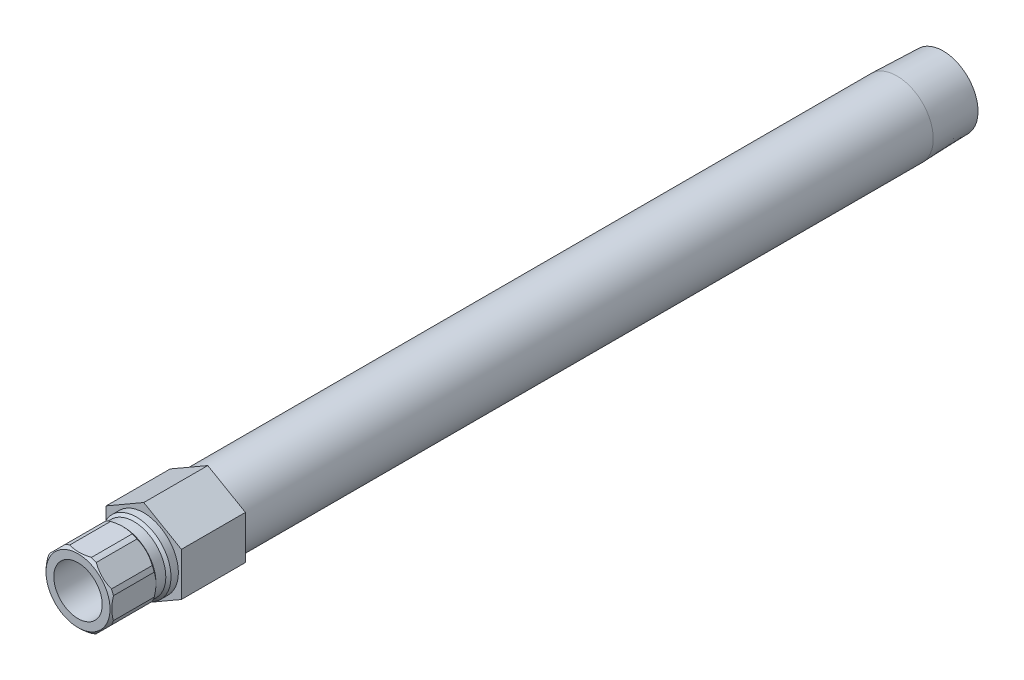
from build123d import *

# Parameters (mm, degrees)
SKETCH2_R           = 7.112
BOSS_EXTRUDE1_DEPTH = 18.796
CUT_EXTRUDE1_START  = 5.8166
SKETCH3_OUTSIDE_W   = 75.344
SKETCH3_OUTSIDE_H   = 78.762
CUT_EXTRUDE1_DEPTH  = 230.485475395


with BuildPart() as part:
    # Sketch1 → Revolve1 (revolve)
    with BuildSketch(Plane(origin=(0, 0, 0), x_dir=(0, 0, -1), z_dir=(1, 0, 0))):
        Polygon((-19.304, 7.112), (-19.304, 9.398), (-18.542, 10.16), (-6.5786, 10.16), (-5.8166, 9.398), (-2.921, 9.398), (-2.159, 10.16), (0, 10.16), (0, 10.668), (221.1324, 10.668), (234.696, 10.244140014), (234.696, 7.8994), (-1.105331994, 7.8994), (-1.524, 7.112), align=None)
    revolve(axis=Axis((0, 0, 0), (0, 0, 1)))

    # Sketch2 → Boss-Extrude1 (add)
    with BuildSketch(Plane.XY):
        Polygon((-11.049, 6.379143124), (-11.049, -6.379143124), (0, -12.758286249), (11.049, -6.379143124), (11.049, 6.379143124), (0, 12.758286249), align=None)
        with Locations(Location((0, 0, 0), (0, 0, 90))):
            Circle(SKETCH2_R, mode=Mode.SUBTRACT)
    extrude(amount=-BOSS_EXTRUDE1_DEPTH)

    # Sketch3 outside → Cut-Extrude1 (cut, through all)
    with BuildSketch(Plane.XY.offset(CUT_EXTRUDE1_START)):
        Rectangle(SKETCH3_OUTSIDE_W, SKETCH3_OUTSIDE_H)
        Polygon((9.652, -3.997989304), (9.652, 3.997989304), (3.997989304, 9.652), (-3.997989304, 9.652), (-9.652, 3.997989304), (-9.652, -3.997989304), (-3.997989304, -9.652), (3.997989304, -9.652), align=None, mode=Mode.SUBTRACT)
    extrude(amount=CUT_EXTRUDE1_DEPTH, mode=Mode.SUBTRACT)


solid = part.part
